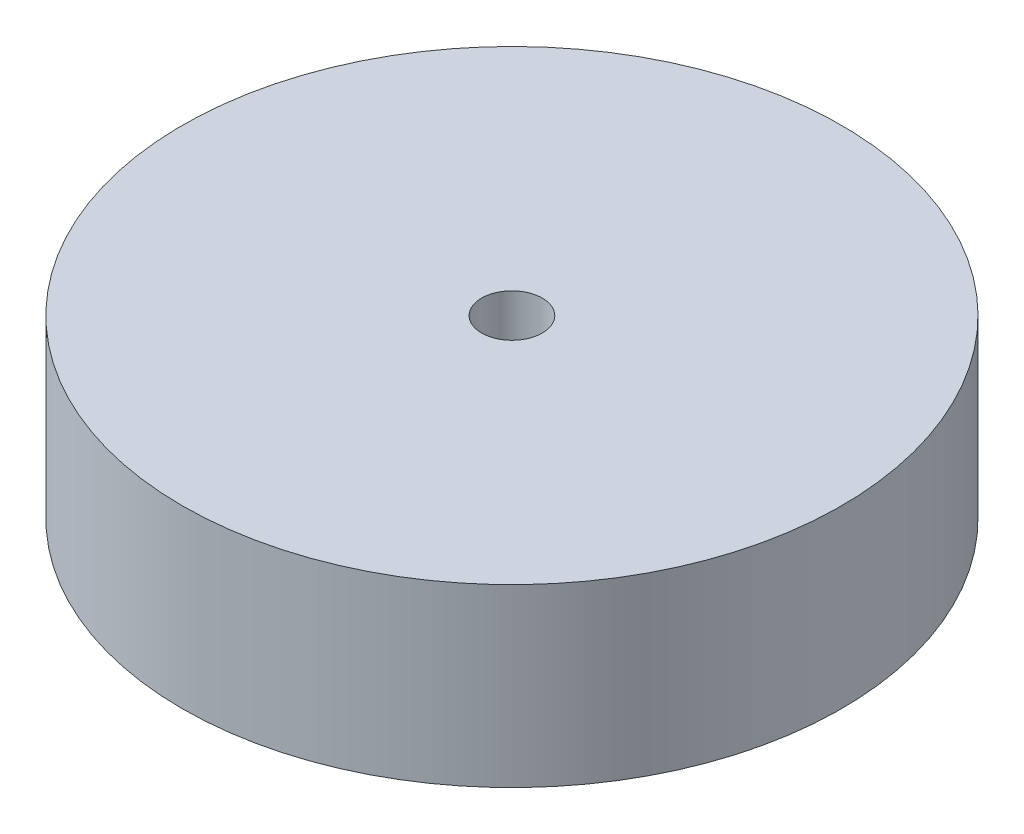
ISO-10303-21;
HEADER;
FILE_DESCRIPTION(('STEP AP214'),'2;1');
FILE_NAME('part.step','',(''),(''),'','','');
FILE_SCHEMA(('AUTOMOTIVE_DESIGN { 1 0 10303 214 1 1 1 1 }'));
ENDSEC;
DATA;
#1=APPLICATION_CONTEXT('core data for automotive mechanical design processes');
#2=APPLICATION_PROTOCOL_DEFINITION('international standard','automotive_design',2000,#1);
#3=PRODUCT_CONTEXT('',#1,'mechanical');
#4=PRODUCT('Part','Part','',(#3));
#5=PRODUCT_RELATED_PRODUCT_CATEGORY('part','',(#4));
#6=PRODUCT_DEFINITION_FORMATION('','',#4);
#7=PRODUCT_DEFINITION_CONTEXT('part definition',#1,'design');
#8=PRODUCT_DEFINITION('design','',#6,#7);
#9=PRODUCT_DEFINITION_SHAPE('','',#8);
#10=(LENGTH_UNIT() NAMED_UNIT(*) SI_UNIT(.MILLI.,.METRE.));
#11=(NAMED_UNIT(*) PLANE_ANGLE_UNIT() SI_UNIT($,.RADIAN.));
#12=(NAMED_UNIT(*) SI_UNIT($,.STERADIAN.) SOLID_ANGLE_UNIT());
#13=UNCERTAINTY_MEASURE_WITH_UNIT(LENGTH_MEASURE(1.E-05),#10,'distance_accuracy_value','');
#14=(GEOMETRIC_REPRESENTATION_CONTEXT(3) GLOBAL_UNCERTAINTY_ASSIGNED_CONTEXT((#13)) GLOBAL_UNIT_ASSIGNED_CONTEXT((#10,
#11,#12)) REPRESENTATION_CONTEXT('',''));
#15=CARTESIAN_POINT('',(0.,0.,0.));
#16=DIRECTION('',(0.,0.,1.));
#17=DIRECTION('',(1.,0.,0.));
#18=AXIS2_PLACEMENT_3D('',#15,#16,#17);
#19=CARTESIAN_POINT('',(0.,10.16,0.));
#20=DIRECTION('',(0.,-1.,0.));
#21=DIRECTION('',(0.,0.,-1.));
#22=AXIS2_PLACEMENT_3D('',#19,#20,#21);
#23=CYLINDRICAL_SURFACE('',#22,19.05);
#24=CARTESIAN_POINT('',(0.,10.16,0.));
#25=DIRECTION('',(0.,1.,0.));
#26=DIRECTION('',(0.,0.,1.));
#27=AXIS2_PLACEMENT_3D('',#24,#25,#26);
#28=CIRCLE('',#27,19.05);
#29=CARTESIAN_POINT('',(0.,10.16,19.05));
#30=VERTEX_POINT('',#29);
#31=EDGE_CURVE('E13',#30,#30,#28,.T.);
#32=ORIENTED_EDGE('',*,*,#31,.F.);
#33=EDGE_LOOP('',(#32));
#34=FACE_BOUND('',#33,.T.);
#35=CARTESIAN_POINT('',(0.,0.,0.));
#36=DIRECTION('',(0.,1.,0.));
#37=DIRECTION('',(0.,0.,1.));
#38=AXIS2_PLACEMENT_3D('',#35,#36,#37);
#39=CIRCLE('',#38,19.05);
#40=CARTESIAN_POINT('',(0.,0.,19.05));
#41=VERTEX_POINT('',#40);
#42=EDGE_CURVE('E46',#41,#41,#39,.T.);
#43=ORIENTED_EDGE('',*,*,#42,.T.);
#44=EDGE_LOOP('',(#43));
#45=FACE_BOUND('',#44,.T.);
#46=ADVANCED_FACE('F43',(#34,#45),#23,.T.);
#47=CARTESIAN_POINT('',(0.,10.16,0.));
#48=DIRECTION('',(0.,1.,0.));
#49=DIRECTION('',(0.,0.,1.));
#50=AXIS2_PLACEMENT_3D('',#47,#48,#49);
#51=PLANE('',#50);
#52=CARTESIAN_POINT('',(0.,10.16,0.));
#53=DIRECTION('',(0.,1.,0.));
#54=DIRECTION('',(0.,0.,1.));
#55=AXIS2_PLACEMENT_3D('',#52,#53,#54);
#56=CIRCLE('',#55,1.75259999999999);
#57=CARTESIAN_POINT('',(0.,10.16,1.75259999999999));
#58=VERTEX_POINT('',#57);
#59=EDGE_CURVE('E69',#58,#58,#56,.T.);
#60=ORIENTED_EDGE('',*,*,#59,.F.);
#61=EDGE_LOOP('',(#60));
#62=FACE_BOUND('',#61,.T.);
#63=ORIENTED_EDGE('',*,*,#31,.T.);
#64=EDGE_LOOP('',(#63));
#65=FACE_BOUND('',#64,.T.);
#66=ADVANCED_FACE('F80',(#62,#65),#51,.T.);
#67=CARTESIAN_POINT('',(0.,0.,0.));
#68=DIRECTION('',(0.,1.,0.));
#69=DIRECTION('',(0.,0.,1.));
#70=AXIS2_PLACEMENT_3D('',#67,#68,#69);
#71=PLANE('',#70);
#72=ORIENTED_EDGE('',*,*,#42,.F.);
#73=EDGE_LOOP('',(#72));
#74=FACE_BOUND('',#73,.T.);
#75=ADVANCED_FACE('F77',(#74),#71,.F.);
#76=CARTESIAN_POINT('',(0.,10.16,0.));
#77=DIRECTION('',(0.,1.,0.));
#78=DIRECTION('',(0.,0.,1.));
#79=AXIS2_PLACEMENT_3D('',#76,#77,#78);
#80=CYLINDRICAL_SURFACE('',#79,1.7526);
#81=CARTESIAN_POINT('',(0.,3.048,0.));
#82=DIRECTION('',(0.,1.,0.));
#83=DIRECTION('',(0.,0.,1.));
#84=AXIS2_PLACEMENT_3D('',#81,#82,#83);
#85=CIRCLE('',#84,1.7526);
#86=CARTESIAN_POINT('',(0.,3.048,1.7526));
#87=VERTEX_POINT('',#86);
#88=EDGE_CURVE('E64',#87,#87,#85,.T.);
#89=ORIENTED_EDGE('',*,*,#88,.F.);
#90=EDGE_LOOP('',(#89));
#91=FACE_BOUND('',#90,.T.);
#92=ORIENTED_EDGE('',*,*,#59,.T.);
#93=EDGE_LOOP('',(#92));
#94=FACE_BOUND('',#93,.T.);
#95=ADVANCED_FACE('F79',(#91,#94),#80,.F.);
#96=CARTESIAN_POINT('',(1.35255,3.048,0.));
#97=DIRECTION('',(0.,-1.,0.));
#98=DIRECTION('',(0.,0.,-1.));
#99=AXIS2_PLACEMENT_3D('',#96,#97,#98);
#100=PLANE('',#99);
#101=CARTESIAN_POINT('',(0.,3.048,0.));
#102=DIRECTION('',(0.,1.,0.));
#103=DIRECTION('',(0.,0.,1.));
#104=AXIS2_PLACEMENT_3D('',#101,#102,#103);
#105=CIRCLE('',#104,1.35255);
#106=CARTESIAN_POINT('',(0.,3.048,1.35255));
#107=VERTEX_POINT('',#106);
#108=EDGE_CURVE('E61',#107,#107,#105,.T.);
#109=ORIENTED_EDGE('',*,*,#108,.F.);
#110=EDGE_LOOP('',(#109));
#111=FACE_BOUND('',#110,.T.);
#112=ORIENTED_EDGE('',*,*,#88,.T.);
#113=EDGE_LOOP('',(#112));
#114=FACE_BOUND('',#113,.T.);
#115=ADVANCED_FACE('F85',(#111,#114),#100,.F.);
#116=CARTESIAN_POINT('',(0.,10.16,0.));
#117=DIRECTION('',(0.,1.,0.));
#118=DIRECTION('',(0.,0.,1.));
#119=AXIS2_PLACEMENT_3D('',#116,#117,#118);
#120=CYLINDRICAL_SURFACE('',#119,1.35255);
#121=CARTESIAN_POINT('',(0.,2.286,0.));
#122=DIRECTION('',(0.,1.,0.));
#123=DIRECTION('',(0.,0.,1.));
#124=AXIS2_PLACEMENT_3D('',#121,#122,#123);
#125=CIRCLE('',#124,1.35255);
#126=CARTESIAN_POINT('',(0.,2.286,1.35255));
#127=VERTEX_POINT('',#126);
#128=EDGE_CURVE('E59',#127,#127,#125,.T.);
#129=ORIENTED_EDGE('',*,*,#128,.F.);
#130=EDGE_LOOP('',(#129));
#131=FACE_BOUND('',#130,.T.);
#132=ORIENTED_EDGE('',*,*,#108,.T.);
#133=EDGE_LOOP('',(#132));
#134=FACE_BOUND('',#133,.T.);
#135=ADVANCED_FACE('F55',(#131,#134),#120,.F.);
#136=CARTESIAN_POINT('',(0.,2.286,0.));
#137=DIRECTION('',(0.,1.,0.));
#138=DIRECTION('',(0.,0.,1.));
#139=AXIS2_PLACEMENT_3D('',#136,#137,#138);
#140=CONICAL_SURFACE('',#139,1.35255,1.02974425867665);
#141=CARTESIAN_POINT('',(0.,1.47330596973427,0.));
#142=VERTEX_POINT('',#141);
#143=VERTEX_LOOP('',#142);
#144=FACE_BOUND('',#143,.T.);
#145=ORIENTED_EDGE('',*,*,#128,.T.);
#146=EDGE_LOOP('',(#145));
#147=FACE_BOUND('',#146,.T.);
#148=ADVANCED_FACE('F52',(#144,#147),#140,.F.);
#149=CLOSED_SHELL('',(#46,#66,#75,#95,#115,#135,#148));
#150=MANIFOLD_SOLID_BREP('B2',#149);
#151=ADVANCED_BREP_SHAPE_REPRESENTATION('',(#18,#150),#14);
#152=SHAPE_DEFINITION_REPRESENTATION(#9,#151);
ENDSEC;
END-ISO-10303-21;
